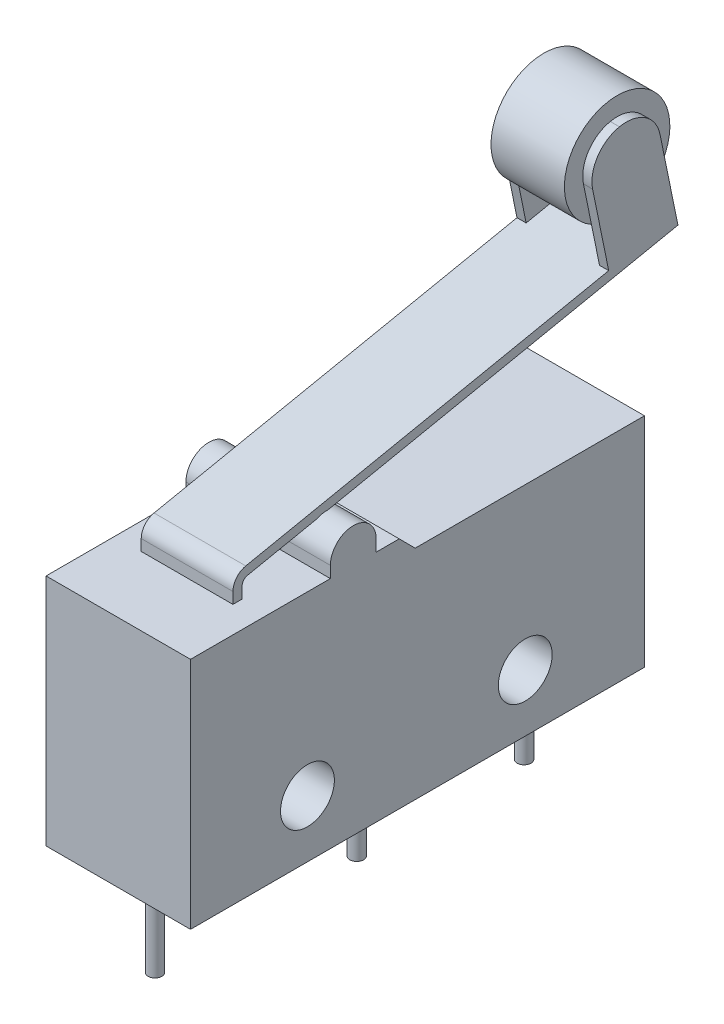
from build123d import *

# Parameters (mm, degrees)
ESQUISSE1_R      = 1.175
EXTRUSION1_DEPTH = 6.3
ESQUISSE2_R      = 0.3
EXTRUSION2_DEPTH = 4
ESQUISSE7_W      = 4
ESQUISSE7_H      = 0.4
ESQUISSE9_W      = 0.4
ESQUISSE9_H      = 3
EXTRUSION3_DEPTH = 5
CONG_1_R         = 1.499
ESQUISSE10_R     = 2.3
EXTRUSION4_DEPTH = 3.2


with BuildPart() as part:
    # Esquisse1 → Extrusion1 (new body)
    with BuildSketch(Plane(origin=(0, 0, 0), x_dir=(0, 0, -1), z_dir=(1, 0, 0))):
        with BuildLine():
            Line((9.8, 9.5), (19.8, 9.5))
            Line((19.8, 9.5), (19.8, 0))
            Line((19.8, 0), (0, 0))
            Line((0, 0), (0, 10.2))
            Line((0, 10.2), (6.1, 10.2))
            Line((6.1, 10.2), (6.1, 10.7))
            ThreePointArc((6.1, 10.7), (7.1, 11.7), (8.1, 10.7))
            Line((8.1, 10.7), (8.1, 10.2))
            Line((8.1, 10.2), (9.102549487, 10.2))
            Line((9.102549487, 10.2), (9.8, 9.5))
        make_face()
        with Locations((14.6, 2.5)):
            Circle(ESQUISSE1_R, mode=Mode.SUBTRACT)
        with Locations((5.1, 2.5)):
            Circle(ESQUISSE1_R, mode=Mode.SUBTRACT)
    extrude(amount=EXTRUSION1_DEPTH)

    # Esquisse2 → Extrusion2 (add)
    with BuildSketch(Plane.XZ):
        with Locations(Location((3.15, -1.6, 0), (0, 0, 90))):
            Circle(ESQUISSE2_R)
        with Locations(Location((3.15, -10.4, 0), (0, 0, 90))):
            Circle(ESQUISSE2_R)
        with Locations(Location((3.15, -17.7, 0), (0, 0, 90))):
            Circle(ESQUISSE2_R)
    extrude(amount=EXTRUSION2_DEPTH)

    # Balayage1: sweep along a path in Esquisse8
    with BuildLine(Plane(origin=(3.15, 0, 0), x_dir=(0, 0, -1), z_dir=(1, 0, 0))) as balayage1_path:
        Line((3.2, 10.2), (3.2, 10.687364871))
        ThreePointArc((3.2, 10.687364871), (3.312633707, 11.003509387), (3.59978942, 11.177219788))
        Line((3.59978942, 11.177219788), (22.368561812, 15.01678431))
    # Esquisse7 → Balayage1 (sweep)
    with BuildSketch(Plane(origin=(0, 10.2, 0), x_dir=(-1, 0, 0), z_dir=(0, 1, 0))):
        with Locations((-3.15, -3.2)):
            Rectangle(ESQUISSE7_W, ESQUISSE7_H)
    sweep(path=balayage1_path.line)

    # Esquisse9 → Extrusion3 (add)
    with BuildSketch(Plane(origin=(0, 10.217352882, 2.090183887), x_dir=(-1, 0, 0), z_dir=(0, 0.979709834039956, 0.20042115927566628))):
        with Locations((-4.95, -23.4243813)):
            Rectangle(ESQUISSE9_W, ESQUISSE9_H)
        with Locations((-1.35, -23.4243813)):
            Rectangle(ESQUISSE9_W, ESQUISSE9_H)
    extrude(amount=EXTRUSION3_DEPTH)

    # Cong_1
    cong_1_edges = [part.edges().sort_by_distance(p)[0] for p in [
        (1.35, 19.510011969, -18.387242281),
        (1.35, 20.111275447, -21.326371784),
        (4.95, 20.111275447, -21.326371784),
        (4.95, 19.510011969, -18.387242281),
    ]]
    fillet(cong_1_edges, radius=CONG_1_R)

    # Esquisse10 → Extrusion4 (add)
    with BuildSketch(Plane(origin=(1.55, 0, 0), x_dir=(0, 0, -1), z_dir=(1, 0, 0))):
        with Locations(Location((20.15723835, 18.342058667, 0), (0, 0, 240.855881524))):
            Circle(ESQUISSE10_R)
    extrude(amount=EXTRUSION4_DEPTH)


solid = part.part
